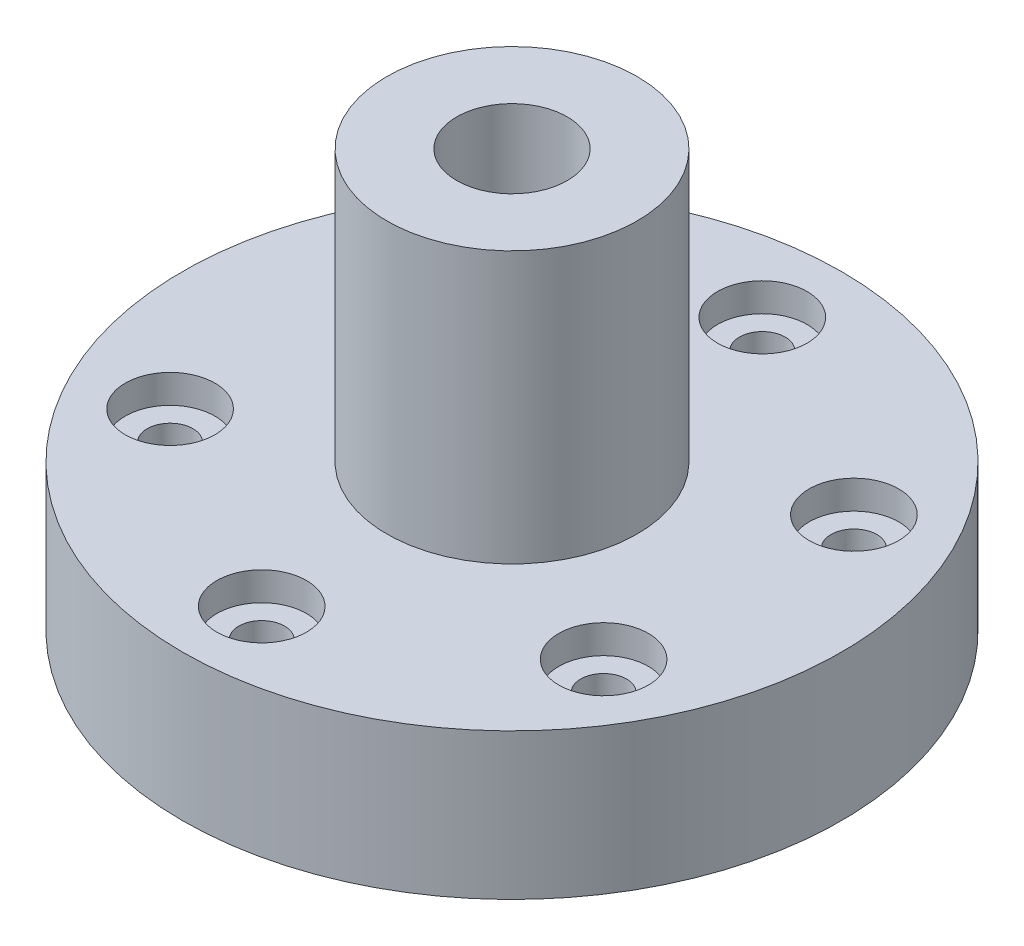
ISO-10303-21;
HEADER;
FILE_DESCRIPTION(('STEP AP214'),'2;1');
FILE_NAME('part.step','',(''),(''),'','','');
FILE_SCHEMA(('AUTOMOTIVE_DESIGN { 1 0 10303 214 1 1 1 1 }'));
ENDSEC;
DATA;
#1=APPLICATION_CONTEXT('core data for automotive mechanical design processes');
#2=APPLICATION_PROTOCOL_DEFINITION('international standard','automotive_design',2000,#1);
#3=PRODUCT_CONTEXT('',#1,'mechanical');
#4=PRODUCT('Part','Part','',(#3));
#5=PRODUCT_RELATED_PRODUCT_CATEGORY('part','',(#4));
#6=PRODUCT_DEFINITION_FORMATION('','',#4);
#7=PRODUCT_DEFINITION_CONTEXT('part definition',#1,'design');
#8=PRODUCT_DEFINITION('design','',#6,#7);
#9=PRODUCT_DEFINITION_SHAPE('','',#8);
#10=(LENGTH_UNIT() NAMED_UNIT(*) SI_UNIT(.MILLI.,.METRE.));
#11=(NAMED_UNIT(*) PLANE_ANGLE_UNIT() SI_UNIT($,.RADIAN.));
#12=(NAMED_UNIT(*) SI_UNIT($,.STERADIAN.) SOLID_ANGLE_UNIT());
#13=UNCERTAINTY_MEASURE_WITH_UNIT(LENGTH_MEASURE(1.E-05),#10,'distance_accuracy_value','');
#14=(GEOMETRIC_REPRESENTATION_CONTEXT(3) GLOBAL_UNCERTAINTY_ASSIGNED_CONTEXT((#13)) GLOBAL_UNIT_ASSIGNED_CONTEXT((#10,
#11,#12)) REPRESENTATION_CONTEXT('',''));
#15=CARTESIAN_POINT('',(0.,0.,0.));
#16=DIRECTION('',(0.,0.,1.));
#17=DIRECTION('',(1.,0.,0.));
#18=AXIS2_PLACEMENT_3D('',#15,#16,#17);
#19=CARTESIAN_POINT('',(0.,20.,0.));
#20=DIRECTION('',(0.,-1.,0.));
#21=DIRECTION('',(0.,0.,-1.));
#22=AXIS2_PLACEMENT_3D('',#19,#20,#21);
#23=CYLINDRICAL_SURFACE('',#22,79.);
#24=CARTESIAN_POINT('',(0.,0.,0.));
#25=DIRECTION('',(0.,-1.,0.));
#26=DIRECTION('',(0.,0.,-1.));
#27=AXIS2_PLACEMENT_3D('',#24,#25,#26);
#28=CIRCLE('',#27,79.);
#29=CARTESIAN_POINT('',(0.,0.,-79.));
#30=VERTEX_POINT('',#29);
#31=EDGE_CURVE('E52',#30,#30,#28,.T.);
#32=ORIENTED_EDGE('',*,*,#31,.F.);
#33=EDGE_LOOP('',(#32));
#34=FACE_BOUND('',#33,.T.);
#35=CARTESIAN_POINT('',(0.,35.,0.));
#36=DIRECTION('',(0.,-1.,0.));
#37=DIRECTION('',(0.,0.,-1.));
#38=AXIS2_PLACEMENT_3D('',#35,#36,#37);
#39=CIRCLE('',#38,79.);
#40=CARTESIAN_POINT('',(0.,35.,-79.));
#41=VERTEX_POINT('',#40);
#42=EDGE_CURVE('E11',#41,#41,#39,.T.);
#43=ORIENTED_EDGE('',*,*,#42,.T.);
#44=EDGE_LOOP('',(#43));
#45=FACE_BOUND('',#44,.T.);
#46=ADVANCED_FACE('F33',(#34,#45),#23,.T.);
#47=CARTESIAN_POINT('',(-79.,35.,0.));
#48=DIRECTION('',(0.,-1.,0.));
#49=DIRECTION('',(0.,0.,-1.));
#50=AXIS2_PLACEMENT_3D('',#47,#48,#49);
#51=PLANE('',#50);
#52=CARTESIAN_POINT('',(-51.961524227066,35.,-30.0000000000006));
#53=DIRECTION('',(0.,1.,0.));
#54=DIRECTION('',(0.,0.,1.));
#55=AXIS2_PLACEMENT_3D('',#52,#53,#54);
#56=CIRCLE('',#55,10.74);
#57=CARTESIAN_POINT('',(-51.961524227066,35.,-19.2600000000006));
#58=VERTEX_POINT('',#57);
#59=EDGE_CURVE('E196',#58,#58,#56,.T.);
#60=ORIENTED_EDGE('',*,*,#59,.F.);
#61=EDGE_LOOP('',(#60));
#62=FACE_BOUND('',#61,.T.);
#63=CARTESIAN_POINT('',(-51.9615242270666,35.,29.9999999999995));
#64=DIRECTION('',(0.,1.,0.));
#65=DIRECTION('',(0.,0.,1.));
#66=AXIS2_PLACEMENT_3D('',#63,#64,#65);
#67=CIRCLE('',#66,10.74);
#68=CARTESIAN_POINT('',(-51.9615242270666,35.,40.7399999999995));
#69=VERTEX_POINT('',#68);
#70=EDGE_CURVE('E205',#69,#69,#67,.T.);
#71=ORIENTED_EDGE('',*,*,#70,.F.);
#72=EDGE_LOOP('',(#71));
#73=FACE_BOUND('',#72,.T.);
#74=CARTESIAN_POINT('',(-4.18978003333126E-13,35.,60.));
#75=DIRECTION('',(0.,1.,0.));
#76=DIRECTION('',(0.,0.,1.));
#77=AXIS2_PLACEMENT_3D('',#74,#75,#76);
#78=CIRCLE('',#77,10.74);
#79=CARTESIAN_POINT('',(-4.18978003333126E-13,35.,70.74));
#80=VERTEX_POINT('',#79);
#81=EDGE_CURVE('E217',#80,#80,#78,.T.);
#82=ORIENTED_EDGE('',*,*,#81,.F.);
#83=EDGE_LOOP('',(#82));
#84=FACE_BOUND('',#83,.T.);
#85=CARTESIAN_POINT('',(51.9615242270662,35.,30.0000000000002));
#86=DIRECTION('',(0.,1.,0.));
#87=DIRECTION('',(0.,0.,1.));
#88=AXIS2_PLACEMENT_3D('',#85,#86,#87);
#89=CIRCLE('',#88,10.74);
#90=CARTESIAN_POINT('',(51.9615242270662,35.,40.7400000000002));
#91=VERTEX_POINT('',#90);
#92=EDGE_CURVE('E229',#91,#91,#89,.T.);
#93=ORIENTED_EDGE('',*,*,#92,.F.);
#94=EDGE_LOOP('',(#93));
#95=FACE_BOUND('',#94,.T.);
#96=CARTESIAN_POINT('',(51.9615242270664,35.,-29.9999999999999));
#97=DIRECTION('',(0.,1.,0.));
#98=DIRECTION('',(0.,0.,1.));
#99=AXIS2_PLACEMENT_3D('',#96,#97,#98);
#100=CIRCLE('',#99,10.74);
#101=CARTESIAN_POINT('',(51.9615242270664,35.,-19.2599999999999));
#102=VERTEX_POINT('',#101);
#103=EDGE_CURVE('E241',#102,#102,#100,.T.);
#104=ORIENTED_EDGE('',*,*,#103,.F.);
#105=EDGE_LOOP('',(#104));
#106=FACE_BOUND('',#105,.T.);
#107=CARTESIAN_POINT('',(0.,35.,-60.));
#108=DIRECTION('',(0.,1.,0.));
#109=DIRECTION('',(0.,0.,1.));
#110=AXIS2_PLACEMENT_3D('',#107,#108,#109);
#111=CIRCLE('',#110,10.74);
#112=CARTESIAN_POINT('',(0.,35.,-49.26));
#113=VERTEX_POINT('',#112);
#114=EDGE_CURVE('E253',#113,#113,#111,.T.);
#115=ORIENTED_EDGE('',*,*,#114,.F.);
#116=EDGE_LOOP('',(#115));
#117=FACE_BOUND('',#116,.T.);
#118=ORIENTED_EDGE('',*,*,#42,.F.);
#119=EDGE_LOOP('',(#118));
#120=FACE_BOUND('',#119,.T.);
#121=CARTESIAN_POINT('',(0.,35.,0.));
#122=DIRECTION('',(0.,-1.,0.));
#123=DIRECTION('',(0.,0.,-1.));
#124=AXIS2_PLACEMENT_3D('',#121,#122,#123);
#125=CIRCLE('',#124,30.);
#126=CARTESIAN_POINT('',(0.,35.,-30.));
#127=VERTEX_POINT('',#126);
#128=EDGE_CURVE('E39',#127,#127,#125,.T.);
#129=ORIENTED_EDGE('',*,*,#128,.T.);
#130=EDGE_LOOP('',(#129));
#131=FACE_BOUND('',#130,.T.);
#132=ADVANCED_FACE('F73',(#62,#73,#84,#95,#106,#117,#120,#131),#51,.F.);
#133=CARTESIAN_POINT('',(0.,20.,0.));
#134=DIRECTION('',(0.,-1.,0.));
#135=DIRECTION('',(0.,0.,-1.));
#136=AXIS2_PLACEMENT_3D('',#133,#134,#135);
#137=CYLINDRICAL_SURFACE('',#136,30.);
#138=ORIENTED_EDGE('',*,*,#128,.F.);
#139=EDGE_LOOP('',(#138));
#140=FACE_BOUND('',#139,.T.);
#141=CARTESIAN_POINT('',(0.,100.,0.));
#142=DIRECTION('',(0.,-1.,0.));
#143=DIRECTION('',(0.,0.,-1.));
#144=AXIS2_PLACEMENT_3D('',#141,#142,#143);
#145=CIRCLE('',#144,30.);
#146=CARTESIAN_POINT('',(0.,100.,-30.));
#147=VERTEX_POINT('',#146);
#148=EDGE_CURVE('E68',#147,#147,#145,.T.);
#149=ORIENTED_EDGE('',*,*,#148,.T.);
#150=EDGE_LOOP('',(#149));
#151=FACE_BOUND('',#150,.T.);
#152=ADVANCED_FACE('F75',(#140,#151),#137,.T.);
#153=CARTESIAN_POINT('',(0.,100.,0.));
#154=DIRECTION('',(0.,-1.,0.));
#155=DIRECTION('',(0.,0.,-1.));
#156=AXIS2_PLACEMENT_3D('',#153,#154,#155);
#157=PLANE('',#156);
#158=CARTESIAN_POINT('',(0.,100.,0.));
#159=DIRECTION('',(0.,1.,0.));
#160=DIRECTION('',(0.,0.,1.));
#161=AXIS2_PLACEMENT_3D('',#158,#159,#160);
#162=CIRCLE('',#161,13.25);
#163=CARTESIAN_POINT('',(0.,100.,13.25));
#164=VERTEX_POINT('',#163);
#165=EDGE_CURVE('E53',#164,#164,#162,.T.);
#166=ORIENTED_EDGE('',*,*,#165,.F.);
#167=EDGE_LOOP('',(#166));
#168=FACE_BOUND('',#167,.T.);
#169=ORIENTED_EDGE('',*,*,#148,.F.);
#170=EDGE_LOOP('',(#169));
#171=FACE_BOUND('',#170,.T.);
#172=ADVANCED_FACE('F78',(#168,#171),#157,.F.);
#173=CARTESIAN_POINT('',(-29.,20.,0.));
#174=DIRECTION('',(0.,1.,0.));
#175=DIRECTION('',(0.,0.,1.));
#176=AXIS2_PLACEMENT_3D('',#173,#174,#175);
#177=PLANE('',#176);
#178=CARTESIAN_POINT('',(0.,20.,0.));
#179=DIRECTION('',(0.,-1.,0.));
#180=DIRECTION('',(0.,0.,-1.));
#181=AXIS2_PLACEMENT_3D('',#178,#179,#180);
#182=CIRCLE('',#181,29.);
#183=CARTESIAN_POINT('',(0.,20.,-29.));
#184=VERTEX_POINT('',#183);
#185=EDGE_CURVE('E65',#184,#184,#182,.T.);
#186=ORIENTED_EDGE('',*,*,#185,.T.);
#187=EDGE_LOOP('',(#186));
#188=FACE_BOUND('',#187,.T.);
#189=ADVANCED_FACE('F83',(#188),#177,.F.);
#190=CARTESIAN_POINT('',(0.,20.,0.));
#191=DIRECTION('',(0.,-1.,0.));
#192=DIRECTION('',(0.,0.,-1.));
#193=AXIS2_PLACEMENT_3D('',#190,#191,#192);
#194=CYLINDRICAL_SURFACE('',#193,29.);
#195=ORIENTED_EDGE('',*,*,#185,.F.);
#196=EDGE_LOOP('',(#195));
#197=FACE_BOUND('',#196,.T.);
#198=CARTESIAN_POINT('',(0.,0.,0.));
#199=DIRECTION('',(0.,-1.,0.));
#200=DIRECTION('',(0.,0.,-1.));
#201=AXIS2_PLACEMENT_3D('',#198,#199,#200);
#202=CIRCLE('',#201,29.);
#203=CARTESIAN_POINT('',(0.,0.,-29.));
#204=VERTEX_POINT('',#203);
#205=EDGE_CURVE('E56',#204,#204,#202,.T.);
#206=ORIENTED_EDGE('',*,*,#205,.T.);
#207=EDGE_LOOP('',(#206));
#208=FACE_BOUND('',#207,.T.);
#209=ADVANCED_FACE('F89',(#197,#208),#194,.F.);
#210=CARTESIAN_POINT('',(-29.,0.,0.));
#211=DIRECTION('',(0.,1.,0.));
#212=DIRECTION('',(0.,0.,1.));
#213=AXIS2_PLACEMENT_3D('',#210,#211,#212);
#214=PLANE('',#213);
#215=CARTESIAN_POINT('',(-51.961524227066,0.,-30.0000000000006));
#216=DIRECTION('',(0.,1.,0.));
#217=DIRECTION('',(0.,0.,1.));
#218=AXIS2_PLACEMENT_3D('',#215,#216,#217);
#219=CIRCLE('',#218,5.49999999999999);
#220=CARTESIAN_POINT('',(-51.961524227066,0.,-24.5000000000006));
#221=VERTEX_POINT('',#220);
#222=EDGE_CURVE('E203',#221,#221,#219,.T.);
#223=ORIENTED_EDGE('',*,*,#222,.T.);
#224=EDGE_LOOP('',(#223));
#225=FACE_BOUND('',#224,.T.);
#226=CARTESIAN_POINT('',(-51.9615242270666,0.,29.9999999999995));
#227=DIRECTION('',(0.,1.,0.));
#228=DIRECTION('',(0.,0.,1.));
#229=AXIS2_PLACEMENT_3D('',#226,#227,#228);
#230=CIRCLE('',#229,5.49999999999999);
#231=CARTESIAN_POINT('',(-51.9615242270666,0.,35.4999999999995));
#232=VERTEX_POINT('',#231);
#233=EDGE_CURVE('E214',#232,#232,#230,.T.);
#234=ORIENTED_EDGE('',*,*,#233,.T.);
#235=EDGE_LOOP('',(#234));
#236=FACE_BOUND('',#235,.T.);
#237=CARTESIAN_POINT('',(-4.18978003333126E-13,0.,60.));
#238=DIRECTION('',(0.,1.,0.));
#239=DIRECTION('',(0.,0.,1.));
#240=AXIS2_PLACEMENT_3D('',#237,#238,#239);
#241=CIRCLE('',#240,5.49999999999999);
#242=CARTESIAN_POINT('',(-4.18978003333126E-13,0.,65.5));
#243=VERTEX_POINT('',#242);
#244=EDGE_CURVE('E226',#243,#243,#241,.T.);
#245=ORIENTED_EDGE('',*,*,#244,.T.);
#246=EDGE_LOOP('',(#245));
#247=FACE_BOUND('',#246,.T.);
#248=CARTESIAN_POINT('',(51.9615242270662,0.,30.0000000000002));
#249=DIRECTION('',(0.,1.,0.));
#250=DIRECTION('',(0.,0.,1.));
#251=AXIS2_PLACEMENT_3D('',#248,#249,#250);
#252=CIRCLE('',#251,5.49999999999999);
#253=CARTESIAN_POINT('',(51.9615242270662,0.,35.5000000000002));
#254=VERTEX_POINT('',#253);
#255=EDGE_CURVE('E238',#254,#254,#252,.T.);
#256=ORIENTED_EDGE('',*,*,#255,.T.);
#257=EDGE_LOOP('',(#256));
#258=FACE_BOUND('',#257,.T.);
#259=CARTESIAN_POINT('',(51.9615242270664,0.,-29.9999999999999));
#260=DIRECTION('',(0.,1.,0.));
#261=DIRECTION('',(0.,0.,1.));
#262=AXIS2_PLACEMENT_3D('',#259,#260,#261);
#263=CIRCLE('',#262,5.49999999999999);
#264=CARTESIAN_POINT('',(51.9615242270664,0.,-24.4999999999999));
#265=VERTEX_POINT('',#264);
#266=EDGE_CURVE('E250',#265,#265,#263,.T.);
#267=ORIENTED_EDGE('',*,*,#266,.T.);
#268=EDGE_LOOP('',(#267));
#269=FACE_BOUND('',#268,.T.);
#270=CARTESIAN_POINT('',(0.,0.,-60.));
#271=DIRECTION('',(0.,1.,0.));
#272=DIRECTION('',(0.,0.,1.));
#273=AXIS2_PLACEMENT_3D('',#270,#271,#272);
#274=CIRCLE('',#273,5.49999999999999);
#275=CARTESIAN_POINT('',(0.,0.,-54.5));
#276=VERTEX_POINT('',#275);
#277=EDGE_CURVE('E59',#276,#276,#274,.T.);
#278=ORIENTED_EDGE('',*,*,#277,.T.);
#279=EDGE_LOOP('',(#278));
#280=FACE_BOUND('',#279,.T.);
#281=ORIENTED_EDGE('',*,*,#205,.F.);
#282=EDGE_LOOP('',(#281));
#283=FACE_BOUND('',#282,.T.);
#284=ORIENTED_EDGE('',*,*,#31,.T.);
#285=EDGE_LOOP('',(#284));
#286=FACE_BOUND('',#285,.T.);
#287=ADVANCED_FACE('F46',(#225,#236,#247,#258,#269,#280,#283,#286),#214,.F.);
#288=CARTESIAN_POINT('',(0.,42.5,0.));
#289=DIRECTION('',(0.,1.,0.));
#290=DIRECTION('',(0.,0.,1.));
#291=AXIS2_PLACEMENT_3D('',#288,#289,#290);
#292=CONICAL_SURFACE('',#291,13.25,1.02974425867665);
#293=CARTESIAN_POINT('',(0.,34.5385967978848,0.));
#294=VERTEX_POINT('',#293);
#295=VERTEX_LOOP('',#294);
#296=FACE_BOUND('',#295,.T.);
#297=CARTESIAN_POINT('',(0.,42.5,0.));
#298=DIRECTION('',(0.,1.,0.));
#299=DIRECTION('',(0.,0.,1.));
#300=AXIS2_PLACEMENT_3D('',#297,#298,#299);
#301=CIRCLE('',#300,13.25);
#302=CARTESIAN_POINT('',(0.,42.5,13.25));
#303=VERTEX_POINT('',#302);
#304=EDGE_CURVE('E50',#303,#303,#301,.T.);
#305=ORIENTED_EDGE('',*,*,#304,.T.);
#306=EDGE_LOOP('',(#305));
#307=FACE_BOUND('',#306,.T.);
#308=ADVANCED_FACE('F42',(#296,#307),#292,.F.);
#309=CARTESIAN_POINT('',(0.,100.,0.));
#310=DIRECTION('',(0.,1.,0.));
#311=DIRECTION('',(0.,0.,1.));
#312=AXIS2_PLACEMENT_3D('',#309,#310,#311);
#313=CYLINDRICAL_SURFACE('',#312,13.25);
#314=ORIENTED_EDGE('',*,*,#304,.F.);
#315=EDGE_LOOP('',(#314));
#316=FACE_BOUND('',#315,.T.);
#317=ORIENTED_EDGE('',*,*,#165,.T.);
#318=EDGE_LOOP('',(#317));
#319=FACE_BOUND('',#318,.T.);
#320=ADVANCED_FACE('F45',(#316,#319),#313,.F.);
#321=CARTESIAN_POINT('',(0.,35.,-60.));
#322=DIRECTION('',(0.,1.,0.));
#323=DIRECTION('',(0.,0.,1.));
#324=AXIS2_PLACEMENT_3D('',#321,#322,#323);
#325=CYLINDRICAL_SURFACE('',#324,5.5);
#326=ORIENTED_EDGE('',*,*,#277,.F.);
#327=EDGE_LOOP('',(#326));
#328=FACE_BOUND('',#327,.T.);
#329=CARTESIAN_POINT('',(0.,28.15,-60.));
#330=DIRECTION('',(0.,1.,0.));
#331=DIRECTION('',(0.,0.,1.));
#332=AXIS2_PLACEMENT_3D('',#329,#330,#331);
#333=CIRCLE('',#332,5.5);
#334=CARTESIAN_POINT('',(0.,28.15,-54.5));
#335=VERTEX_POINT('',#334);
#336=EDGE_CURVE('E259',#335,#335,#333,.T.);
#337=ORIENTED_EDGE('',*,*,#336,.T.);
#338=EDGE_LOOP('',(#337));
#339=FACE_BOUND('',#338,.T.);
#340=ADVANCED_FACE('F117',(#328,#339),#325,.F.);
#341=CARTESIAN_POINT('',(5.5,28.15,-60.));
#342=DIRECTION('',(0.,-1.,0.));
#343=DIRECTION('',(0.,0.,-1.));
#344=AXIS2_PLACEMENT_3D('',#341,#342,#343);
#345=PLANE('',#344);
#346=ORIENTED_EDGE('',*,*,#336,.F.);
#347=EDGE_LOOP('',(#346));
#348=FACE_BOUND('',#347,.T.);
#349=CARTESIAN_POINT('',(0.,28.15,-60.));
#350=DIRECTION('',(0.,1.,0.));
#351=DIRECTION('',(0.,0.,1.));
#352=AXIS2_PLACEMENT_3D('',#349,#350,#351);
#353=CIRCLE('',#352,10.74);
#354=CARTESIAN_POINT('',(0.,28.15,-49.26));
#355=VERTEX_POINT('',#354);
#356=EDGE_CURVE('E256',#355,#355,#353,.T.);
#357=ORIENTED_EDGE('',*,*,#356,.T.);
#358=EDGE_LOOP('',(#357));
#359=FACE_BOUND('',#358,.T.);
#360=ADVANCED_FACE('F120',(#348,#359),#345,.F.);
#361=CARTESIAN_POINT('',(0.,35.,-60.));
#362=DIRECTION('',(0.,1.,0.));
#363=DIRECTION('',(0.,0.,1.));
#364=AXIS2_PLACEMENT_3D('',#361,#362,#363);
#365=CYLINDRICAL_SURFACE('',#364,10.74);
#366=ORIENTED_EDGE('',*,*,#356,.F.);
#367=EDGE_LOOP('',(#366));
#368=FACE_BOUND('',#367,.T.);
#369=ORIENTED_EDGE('',*,*,#114,.T.);
#370=EDGE_LOOP('',(#369));
#371=FACE_BOUND('',#370,.T.);
#372=ADVANCED_FACE('F124',(#368,#371),#365,.F.);
#373=CARTESIAN_POINT('',(51.9615242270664,35.,-29.9999999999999));
#374=DIRECTION('',(0.,1.,0.));
#375=DIRECTION('',(0.,0.,1.));
#376=AXIS2_PLACEMENT_3D('',#373,#374,#375);
#377=CYLINDRICAL_SURFACE('',#376,5.5);
#378=ORIENTED_EDGE('',*,*,#266,.F.);
#379=EDGE_LOOP('',(#378));
#380=FACE_BOUND('',#379,.T.);
#381=CARTESIAN_POINT('',(51.9615242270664,28.15,-29.9999999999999));
#382=DIRECTION('',(0.,1.,0.));
#383=DIRECTION('',(0.,0.,1.));
#384=AXIS2_PLACEMENT_3D('',#381,#382,#383);
#385=CIRCLE('',#384,5.50000000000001);
#386=CARTESIAN_POINT('',(51.9615242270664,28.15,-24.4999999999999));
#387=VERTEX_POINT('',#386);
#388=EDGE_CURVE('E247',#387,#387,#385,.T.);
#389=ORIENTED_EDGE('',*,*,#388,.T.);
#390=EDGE_LOOP('',(#389));
#391=FACE_BOUND('',#390,.T.);
#392=ADVANCED_FACE('F128',(#380,#391),#377,.F.);
#393=CARTESIAN_POINT('',(57.4615242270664,28.15,-29.9999999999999));
#394=DIRECTION('',(0.,-1.,0.));
#395=DIRECTION('',(0.,0.,-1.));
#396=AXIS2_PLACEMENT_3D('',#393,#394,#395);
#397=PLANE('',#396);
#398=ORIENTED_EDGE('',*,*,#388,.F.);
#399=EDGE_LOOP('',(#398));
#400=FACE_BOUND('',#399,.T.);
#401=CARTESIAN_POINT('',(51.9615242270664,28.15,-29.9999999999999));
#402=DIRECTION('',(0.,1.,0.));
#403=DIRECTION('',(0.,0.,1.));
#404=AXIS2_PLACEMENT_3D('',#401,#402,#403);
#405=CIRCLE('',#404,10.74);
#406=CARTESIAN_POINT('',(51.9615242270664,28.15,-19.2599999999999));
#407=VERTEX_POINT('',#406);
#408=EDGE_CURVE('E244',#407,#407,#405,.T.);
#409=ORIENTED_EDGE('',*,*,#408,.T.);
#410=EDGE_LOOP('',(#409));
#411=FACE_BOUND('',#410,.T.);
#412=ADVANCED_FACE('F132',(#400,#411),#397,.F.);
#413=CARTESIAN_POINT('',(51.9615242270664,35.,-29.9999999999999));
#414=DIRECTION('',(0.,1.,0.));
#415=DIRECTION('',(0.,0.,1.));
#416=AXIS2_PLACEMENT_3D('',#413,#414,#415);
#417=CYLINDRICAL_SURFACE('',#416,10.74);
#418=ORIENTED_EDGE('',*,*,#408,.F.);
#419=EDGE_LOOP('',(#418));
#420=FACE_BOUND('',#419,.T.);
#421=ORIENTED_EDGE('',*,*,#103,.T.);
#422=EDGE_LOOP('',(#421));
#423=FACE_BOUND('',#422,.T.);
#424=ADVANCED_FACE('F136',(#420,#423),#417,.F.);
#425=CARTESIAN_POINT('',(51.9615242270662,35.,30.0000000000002));
#426=DIRECTION('',(0.,1.,0.));
#427=DIRECTION('',(0.,0.,1.));
#428=AXIS2_PLACEMENT_3D('',#425,#426,#427);
#429=CYLINDRICAL_SURFACE('',#428,5.49999999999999);
#430=ORIENTED_EDGE('',*,*,#255,.F.);
#431=EDGE_LOOP('',(#430));
#432=FACE_BOUND('',#431,.T.);
#433=CARTESIAN_POINT('',(51.9615242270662,28.15,30.0000000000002));
#434=DIRECTION('',(0.,1.,0.));
#435=DIRECTION('',(0.,0.,1.));
#436=AXIS2_PLACEMENT_3D('',#433,#434,#435);
#437=CIRCLE('',#436,5.5);
#438=CARTESIAN_POINT('',(51.9615242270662,28.15,35.5000000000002));
#439=VERTEX_POINT('',#438);
#440=EDGE_CURVE('E235',#439,#439,#437,.T.);
#441=ORIENTED_EDGE('',*,*,#440,.T.);
#442=EDGE_LOOP('',(#441));
#443=FACE_BOUND('',#442,.T.);
#444=ADVANCED_FACE('F140',(#432,#443),#429,.F.);
#445=CARTESIAN_POINT('',(57.4615242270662,28.15,30.0000000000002));
#446=DIRECTION('',(0.,-1.,0.));
#447=DIRECTION('',(0.,0.,-1.));
#448=AXIS2_PLACEMENT_3D('',#445,#446,#447);
#449=PLANE('',#448);
#450=ORIENTED_EDGE('',*,*,#440,.F.);
#451=EDGE_LOOP('',(#450));
#452=FACE_BOUND('',#451,.T.);
#453=CARTESIAN_POINT('',(51.9615242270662,28.15,30.0000000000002));
#454=DIRECTION('',(0.,1.,0.));
#455=DIRECTION('',(0.,0.,1.));
#456=AXIS2_PLACEMENT_3D('',#453,#454,#455);
#457=CIRCLE('',#456,10.74);
#458=CARTESIAN_POINT('',(51.9615242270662,28.15,40.7400000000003));
#459=VERTEX_POINT('',#458);
#460=EDGE_CURVE('E232',#459,#459,#457,.T.);
#461=ORIENTED_EDGE('',*,*,#460,.T.);
#462=EDGE_LOOP('',(#461));
#463=FACE_BOUND('',#462,.T.);
#464=ADVANCED_FACE('F144',(#452,#463),#449,.F.);
#465=CARTESIAN_POINT('',(51.9615242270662,35.,30.0000000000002));
#466=DIRECTION('',(0.,1.,0.));
#467=DIRECTION('',(0.,0.,1.));
#468=AXIS2_PLACEMENT_3D('',#465,#466,#467);
#469=CYLINDRICAL_SURFACE('',#468,10.74);
#470=ORIENTED_EDGE('',*,*,#460,.F.);
#471=EDGE_LOOP('',(#470));
#472=FACE_BOUND('',#471,.T.);
#473=ORIENTED_EDGE('',*,*,#92,.T.);
#474=EDGE_LOOP('',(#473));
#475=FACE_BOUND('',#474,.T.);
#476=ADVANCED_FACE('F148',(#472,#475),#469,.F.);
#477=CARTESIAN_POINT('',(-4.18978003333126E-13,35.,60.));
#478=DIRECTION('',(0.,1.,0.));
#479=DIRECTION('',(0.,0.,1.));
#480=AXIS2_PLACEMENT_3D('',#477,#478,#479);
#481=CYLINDRICAL_SURFACE('',#480,5.5);
#482=ORIENTED_EDGE('',*,*,#244,.F.);
#483=EDGE_LOOP('',(#482));
#484=FACE_BOUND('',#483,.T.);
#485=CARTESIAN_POINT('',(-4.18978003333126E-13,28.15,60.));
#486=DIRECTION('',(0.,1.,0.));
#487=DIRECTION('',(0.,0.,1.));
#488=AXIS2_PLACEMENT_3D('',#485,#486,#487);
#489=CIRCLE('',#488,5.5);
#490=CARTESIAN_POINT('',(-4.18978003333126E-13,28.15,65.5));
#491=VERTEX_POINT('',#490);
#492=EDGE_CURVE('E223',#491,#491,#489,.T.);
#493=ORIENTED_EDGE('',*,*,#492,.T.);
#494=EDGE_LOOP('',(#493));
#495=FACE_BOUND('',#494,.T.);
#496=ADVANCED_FACE('F152',(#484,#495),#481,.F.);
#497=CARTESIAN_POINT('',(5.49999999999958,28.15,60.));
#498=DIRECTION('',(0.,-1.,0.));
#499=DIRECTION('',(0.,0.,-1.));
#500=AXIS2_PLACEMENT_3D('',#497,#498,#499);
#501=PLANE('',#500);
#502=ORIENTED_EDGE('',*,*,#492,.F.);
#503=EDGE_LOOP('',(#502));
#504=FACE_BOUND('',#503,.T.);
#505=CARTESIAN_POINT('',(-4.18978003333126E-13,28.15,60.));
#506=DIRECTION('',(0.,1.,0.));
#507=DIRECTION('',(0.,0.,1.));
#508=AXIS2_PLACEMENT_3D('',#505,#506,#507);
#509=CIRCLE('',#508,10.74);
#510=CARTESIAN_POINT('',(-4.18978003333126E-13,28.15,70.74));
#511=VERTEX_POINT('',#510);
#512=EDGE_CURVE('E220',#511,#511,#509,.T.);
#513=ORIENTED_EDGE('',*,*,#512,.T.);
#514=EDGE_LOOP('',(#513));
#515=FACE_BOUND('',#514,.T.);
#516=ADVANCED_FACE('F156',(#504,#515),#501,.F.);
#517=CARTESIAN_POINT('',(-4.18978003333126E-13,35.,60.));
#518=DIRECTION('',(0.,1.,0.));
#519=DIRECTION('',(0.,0.,1.));
#520=AXIS2_PLACEMENT_3D('',#517,#518,#519);
#521=CYLINDRICAL_SURFACE('',#520,10.74);
#522=ORIENTED_EDGE('',*,*,#512,.F.);
#523=EDGE_LOOP('',(#522));
#524=FACE_BOUND('',#523,.T.);
#525=ORIENTED_EDGE('',*,*,#81,.T.);
#526=EDGE_LOOP('',(#525));
#527=FACE_BOUND('',#526,.T.);
#528=ADVANCED_FACE('F160',(#524,#527),#521,.F.);
#529=CARTESIAN_POINT('',(-51.9615242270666,35.,29.9999999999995));
#530=DIRECTION('',(0.,1.,0.));
#531=DIRECTION('',(0.,0.,1.));
#532=AXIS2_PLACEMENT_3D('',#529,#530,#531);
#533=CYLINDRICAL_SURFACE('',#532,5.5);
#534=ORIENTED_EDGE('',*,*,#233,.F.);
#535=EDGE_LOOP('',(#534));
#536=FACE_BOUND('',#535,.T.);
#537=CARTESIAN_POINT('',(-51.9615242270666,28.15,29.9999999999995));
#538=DIRECTION('',(0.,1.,0.));
#539=DIRECTION('',(0.,0.,1.));
#540=AXIS2_PLACEMENT_3D('',#537,#538,#539);
#541=CIRCLE('',#540,5.50000000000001);
#542=CARTESIAN_POINT('',(-51.9615242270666,28.15,35.4999999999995));
#543=VERTEX_POINT('',#542);
#544=EDGE_CURVE('E211',#543,#543,#541,.T.);
#545=ORIENTED_EDGE('',*,*,#544,.T.);
#546=EDGE_LOOP('',(#545));
#547=FACE_BOUND('',#546,.T.);
#548=ADVANCED_FACE('F164',(#536,#547),#533,.F.);
#549=CARTESIAN_POINT('',(-46.4615242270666,28.15,29.9999999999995));
#550=DIRECTION('',(0.,-1.,0.));
#551=DIRECTION('',(0.,0.,-1.));
#552=AXIS2_PLACEMENT_3D('',#549,#550,#551);
#553=PLANE('',#552);
#554=ORIENTED_EDGE('',*,*,#544,.F.);
#555=EDGE_LOOP('',(#554));
#556=FACE_BOUND('',#555,.T.);
#557=CARTESIAN_POINT('',(-51.9615242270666,28.15,29.9999999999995));
#558=DIRECTION('',(0.,1.,0.));
#559=DIRECTION('',(0.,0.,1.));
#560=AXIS2_PLACEMENT_3D('',#557,#558,#559);
#561=CIRCLE('',#560,10.74);
#562=CARTESIAN_POINT('',(-51.9615242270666,28.15,40.7399999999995));
#563=VERTEX_POINT('',#562);
#564=EDGE_CURVE('E208',#563,#563,#561,.T.);
#565=ORIENTED_EDGE('',*,*,#564,.T.);
#566=EDGE_LOOP('',(#565));
#567=FACE_BOUND('',#566,.T.);
#568=ADVANCED_FACE('F168',(#556,#567),#553,.F.);
#569=CARTESIAN_POINT('',(-51.9615242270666,35.,29.9999999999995));
#570=DIRECTION('',(0.,1.,0.));
#571=DIRECTION('',(0.,0.,1.));
#572=AXIS2_PLACEMENT_3D('',#569,#570,#571);
#573=CYLINDRICAL_SURFACE('',#572,10.74);
#574=ORIENTED_EDGE('',*,*,#564,.F.);
#575=EDGE_LOOP('',(#574));
#576=FACE_BOUND('',#575,.T.);
#577=ORIENTED_EDGE('',*,*,#70,.T.);
#578=EDGE_LOOP('',(#577));
#579=FACE_BOUND('',#578,.T.);
#580=ADVANCED_FACE('F172',(#576,#579),#573,.F.);
#581=CARTESIAN_POINT('',(-51.961524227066,35.,-30.0000000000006));
#582=DIRECTION('',(0.,1.,0.));
#583=DIRECTION('',(0.,0.,1.));
#584=AXIS2_PLACEMENT_3D('',#581,#582,#583);
#585=CYLINDRICAL_SURFACE('',#584,5.49999999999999);
#586=ORIENTED_EDGE('',*,*,#222,.F.);
#587=EDGE_LOOP('',(#586));
#588=FACE_BOUND('',#587,.T.);
#589=CARTESIAN_POINT('',(-51.961524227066,28.15,-30.0000000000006));
#590=DIRECTION('',(0.,1.,0.));
#591=DIRECTION('',(0.,0.,1.));
#592=AXIS2_PLACEMENT_3D('',#589,#590,#591);
#593=CIRCLE('',#592,5.5);
#594=CARTESIAN_POINT('',(-51.961524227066,28.15,-24.5000000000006));
#595=VERTEX_POINT('',#594);
#596=EDGE_CURVE('E198',#595,#595,#593,.T.);
#597=ORIENTED_EDGE('',*,*,#596,.T.);
#598=EDGE_LOOP('',(#597));
#599=FACE_BOUND('',#598,.T.);
#600=ADVANCED_FACE('F176',(#588,#599),#585,.F.);
#601=CARTESIAN_POINT('',(-46.461524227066,28.15,-30.0000000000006));
#602=DIRECTION('',(0.,-1.,0.));
#603=DIRECTION('',(0.,0.,-1.));
#604=AXIS2_PLACEMENT_3D('',#601,#602,#603);
#605=PLANE('',#604);
#606=ORIENTED_EDGE('',*,*,#596,.F.);
#607=EDGE_LOOP('',(#606));
#608=FACE_BOUND('',#607,.T.);
#609=CARTESIAN_POINT('',(-51.961524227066,28.15,-30.0000000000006));
#610=DIRECTION('',(0.,1.,0.));
#611=DIRECTION('',(0.,0.,1.));
#612=AXIS2_PLACEMENT_3D('',#609,#610,#611);
#613=CIRCLE('',#612,10.74);
#614=CARTESIAN_POINT('',(-51.961524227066,28.15,-19.2600000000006));
#615=VERTEX_POINT('',#614);
#616=EDGE_CURVE('E193',#615,#615,#613,.T.);
#617=ORIENTED_EDGE('',*,*,#616,.T.);
#618=EDGE_LOOP('',(#617));
#619=FACE_BOUND('',#618,.T.);
#620=ADVANCED_FACE('F180',(#608,#619),#605,.F.);
#621=CARTESIAN_POINT('',(-51.961524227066,35.,-30.0000000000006));
#622=DIRECTION('',(0.,1.,0.));
#623=DIRECTION('',(0.,0.,1.));
#624=AXIS2_PLACEMENT_3D('',#621,#622,#623);
#625=CYLINDRICAL_SURFACE('',#624,10.74);
#626=ORIENTED_EDGE('',*,*,#616,.F.);
#627=EDGE_LOOP('',(#626));
#628=FACE_BOUND('',#627,.T.);
#629=ORIENTED_EDGE('',*,*,#59,.T.);
#630=EDGE_LOOP('',(#629));
#631=FACE_BOUND('',#630,.T.);
#632=ADVANCED_FACE('F184',(#628,#631),#625,.F.);
#633=CLOSED_SHELL('',(#46,#132,#152,#172,#189,#209,#287,#308,#320,#340,#360,#372,#392,#412,#424,
#444,#464,#476,#496,#516,#528,#548,#568,#580,#600,#620,#632));
#634=MANIFOLD_SOLID_BREP('B2',#633);
#635=ADVANCED_BREP_SHAPE_REPRESENTATION('',(#18,#634),#14);
#636=SHAPE_DEFINITION_REPRESENTATION(#9,#635);
ENDSEC;
END-ISO-10303-21;
